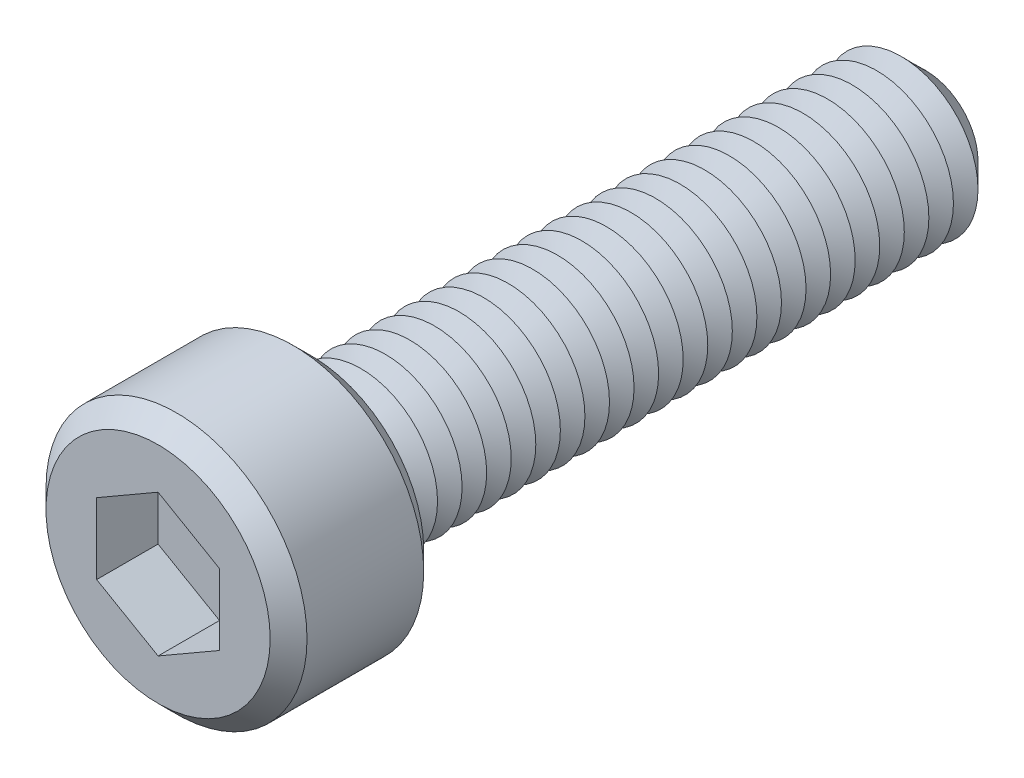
ISO-10303-21;
HEADER;
FILE_DESCRIPTION(('STEP AP214'),'2;1');
FILE_NAME('part.step','',(''),(''),'','','');
FILE_SCHEMA(('AUTOMOTIVE_DESIGN { 1 0 10303 214 1 1 1 1 }'));
ENDSEC;
DATA;
#1=APPLICATION_CONTEXT('core data for automotive mechanical design processes');
#2=APPLICATION_PROTOCOL_DEFINITION('international standard','automotive_design',2000,#1);
#3=PRODUCT_CONTEXT('',#1,'mechanical');
#4=PRODUCT('Part','Part','',(#3));
#5=PRODUCT_RELATED_PRODUCT_CATEGORY('part','',(#4));
#6=PRODUCT_DEFINITION_FORMATION('','',#4);
#7=PRODUCT_DEFINITION_CONTEXT('part definition',#1,'design');
#8=PRODUCT_DEFINITION('design','',#6,#7);
#9=PRODUCT_DEFINITION_SHAPE('','',#8);
#10=(LENGTH_UNIT() NAMED_UNIT(*) SI_UNIT(.MILLI.,.METRE.));
#11=(NAMED_UNIT(*) PLANE_ANGLE_UNIT() SI_UNIT($,.RADIAN.));
#12=(NAMED_UNIT(*) SI_UNIT($,.STERADIAN.) SOLID_ANGLE_UNIT());
#13=UNCERTAINTY_MEASURE_WITH_UNIT(LENGTH_MEASURE(1.E-05),#10,'distance_accuracy_value','');
#14=(GEOMETRIC_REPRESENTATION_CONTEXT(3) GLOBAL_UNCERTAINTY_ASSIGNED_CONTEXT((#13)) GLOBAL_UNIT_ASSIGNED_CONTEXT((#10,
#11,#12)) REPRESENTATION_CONTEXT('',''));
#15=CARTESIAN_POINT('',(0.,0.,0.));
#16=DIRECTION('',(0.,0.,1.));
#17=DIRECTION('',(1.,0.,0.));
#18=AXIS2_PLACEMENT_3D('',#15,#16,#17);
#19=CARTESIAN_POINT('',(0.,0.,5.));
#20=DIRECTION('',(0.,0.,-1.));
#21=DIRECTION('',(-1.,0.,0.));
#22=AXIS2_PLACEMENT_3D('',#19,#20,#21);
#23=CYLINDRICAL_SURFACE('',#22,4.25);
#24=CARTESIAN_POINT('',(0.,0.,0.599999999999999));
#25=DIRECTION('',(0.,0.,1.));
#26=DIRECTION('',(1.,0.,0.));
#27=AXIS2_PLACEMENT_3D('',#24,#25,#26);
#28=CIRCLE('',#27,4.25);
#29=CARTESIAN_POINT('',(4.25,0.,0.599999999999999));
#30=VERTEX_POINT('',#29);
#31=EDGE_CURVE('E368',#30,#30,#28,.T.);
#32=ORIENTED_EDGE('',*,*,#31,.T.);
#33=EDGE_LOOP('',(#32));
#34=FACE_BOUND('',#33,.T.);
#35=CARTESIAN_POINT('',(0.,0.,4.4));
#36=DIRECTION('',(0.,0.,1.));
#37=DIRECTION('',(1.,0.,0.));
#38=AXIS2_PLACEMENT_3D('',#35,#36,#37);
#39=CIRCLE('',#38,4.25);
#40=CARTESIAN_POINT('',(4.25,0.,4.4));
#41=VERTEX_POINT('',#40);
#42=EDGE_CURVE('E364',#41,#41,#39,.F.);
#43=ORIENTED_EDGE('',*,*,#42,.T.);
#44=EDGE_LOOP('',(#43));
#45=FACE_BOUND('',#44,.T.);
#46=ADVANCED_FACE('F39',(#34,#45),#23,.T.);
#47=CARTESIAN_POINT('',(0.,0.,5.));
#48=DIRECTION('',(0.,0.,1.));
#49=DIRECTION('',(1.,0.,0.));
#50=AXIS2_PLACEMENT_3D('',#47,#48,#49);
#51=PLANE('',#50);
#52=CARTESIAN_POINT('',(0.,0.,5.));
#53=DIRECTION('',(0.,0.,1.));
#54=DIRECTION('',(1.,0.,0.));
#55=AXIS2_PLACEMENT_3D('',#52,#53,#54);
#56=CIRCLE('',#55,3.65);
#57=CARTESIAN_POINT('',(3.65,0.,5.));
#58=VERTEX_POINT('',#57);
#59=EDGE_CURVE('E11',#58,#58,#56,.T.);
#60=ORIENTED_EDGE('',*,*,#59,.T.);
#61=EDGE_LOOP('',(#60));
#62=FACE_BOUND('',#61,.T.);
#63=DIRECTION('',(-0.866025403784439,0.5,0.));
#64=VECTOR('',#63,1.);
#65=CARTESIAN_POINT('',(2.,1.15470053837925,5.));
#66=LINE('',#65,#64);
#67=CARTESIAN_POINT('',(2.,1.15470053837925,5.));
#68=VERTEX_POINT('',#67);
#69=CARTESIAN_POINT('',(0.,2.3094010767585,5.));
#70=VERTEX_POINT('',#69);
#71=EDGE_CURVE('E55',#68,#70,#66,.T.);
#72=ORIENTED_EDGE('',*,*,#71,.F.);
#73=DIRECTION('',(0.,1.,0.));
#74=VECTOR('',#73,1.);
#75=CARTESIAN_POINT('',(2.,-1.15470053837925,5.));
#76=LINE('',#75,#74);
#77=CARTESIAN_POINT('',(2.,-1.15470053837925,5.));
#78=VERTEX_POINT('',#77);
#79=EDGE_CURVE('E150',#78,#68,#76,.T.);
#80=ORIENTED_EDGE('',*,*,#79,.F.);
#81=DIRECTION('',(0.866025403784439,0.5,0.));
#82=VECTOR('',#81,1.);
#83=CARTESIAN_POINT('',(0.,-2.3094010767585,5.));
#84=LINE('',#83,#82);
#85=CARTESIAN_POINT('',(0.,-2.3094010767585,5.));
#86=VERTEX_POINT('',#85);
#87=EDGE_CURVE('E147',#86,#78,#84,.T.);
#88=ORIENTED_EDGE('',*,*,#87,.F.);
#89=DIRECTION('',(0.866025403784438,-0.5,0.));
#90=VECTOR('',#89,1.);
#91=CARTESIAN_POINT('',(-2.,-1.15470053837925,5.));
#92=LINE('',#91,#90);
#93=CARTESIAN_POINT('',(-2.,-1.15470053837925,5.));
#94=VERTEX_POINT('',#93);
#95=EDGE_CURVE('E103',#94,#86,#92,.T.);
#96=ORIENTED_EDGE('',*,*,#95,.F.);
#97=DIRECTION('',(0.,-1.,0.));
#98=VECTOR('',#97,1.);
#99=CARTESIAN_POINT('',(-2.,1.15470053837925,5.));
#100=LINE('',#99,#98);
#101=CARTESIAN_POINT('',(-2.,1.15470053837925,5.));
#102=VERTEX_POINT('',#101);
#103=EDGE_CURVE('E141',#102,#94,#100,.T.);
#104=ORIENTED_EDGE('',*,*,#103,.F.);
#105=DIRECTION('',(-0.866025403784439,-0.5,0.));
#106=VECTOR('',#105,1.);
#107=CARTESIAN_POINT('',(0.,2.3094010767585,5.));
#108=LINE('',#107,#106);
#109=EDGE_CURVE('E137',#70,#102,#108,.T.);
#110=ORIENTED_EDGE('',*,*,#109,.F.);
#111=EDGE_LOOP('',(#72,#80,#88,#96,#104,#110));
#112=FACE_BOUND('',#111,.T.);
#113=ADVANCED_FACE('F386',(#62,#112),#51,.T.);
#114=CARTESIAN_POINT('',(0.,0.,0.));
#115=DIRECTION('',(0.,0.,1.));
#116=DIRECTION('',(1.,0.,0.));
#117=AXIS2_PLACEMENT_3D('',#114,#115,#116);
#118=PLANE('',#117);
#119=CARTESIAN_POINT('',(0.,0.,0.));
#120=DIRECTION('',(0.,0.,1.));
#121=DIRECTION('',(1.,0.,0.));
#122=AXIS2_PLACEMENT_3D('',#119,#120,#121);
#123=CIRCLE('',#122,3.65);
#124=CARTESIAN_POINT('',(3.65,0.,0.));
#125=VERTEX_POINT('',#124);
#126=EDGE_CURVE('E48',#125,#125,#123,.F.);
#127=ORIENTED_EDGE('',*,*,#126,.T.);
#128=EDGE_LOOP('',(#127));
#129=FACE_BOUND('',#128,.T.);
#130=CARTESIAN_POINT('',(0.,0.,0.));
#131=DIRECTION('',(0.,0.,1.));
#132=DIRECTION('',(1.,0.,0.));
#133=AXIS2_PLACEMENT_3D('',#130,#131,#132);
#134=CIRCLE('',#133,2.5);
#135=CARTESIAN_POINT('',(2.5,0.,0.));
#136=VERTEX_POINT('',#135);
#137=EDGE_CURVE('E356',#136,#136,#134,.T.);
#138=ORIENTED_EDGE('',*,*,#137,.T.);
#139=EDGE_LOOP('',(#138));
#140=FACE_BOUND('',#139,.T.);
#141=ADVANCED_FACE('F375',(#129,#140),#118,.F.);
#142=CARTESIAN_POINT('',(0.,0.,0.));
#143=DIRECTION('',(0.,0.,1.));
#144=DIRECTION('',(1.,0.,0.));
#145=AXIS2_PLACEMENT_3D('',#142,#143,#144);
#146=CONICAL_SURFACE('',#145,2.5,1.0471975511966);
#147=CARTESIAN_POINT('',(0.,0.,-0.4));
#148=DIRECTION('',(0.,0.,1.));
#149=DIRECTION('',(1.,0.,0.));
#150=AXIS2_PLACEMENT_3D('',#147,#148,#149);
#151=CIRCLE('',#150,1.80717967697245);
#152=CARTESIAN_POINT('',(1.80717967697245,0.,-0.4));
#153=VERTEX_POINT('',#152);
#154=EDGE_CURVE('E352',#153,#153,#151,.T.);
#155=ORIENTED_EDGE('',*,*,#154,.T.);
#156=EDGE_LOOP('',(#155));
#157=FACE_BOUND('',#156,.T.);
#158=ORIENTED_EDGE('',*,*,#137,.F.);
#159=EDGE_LOOP('',(#158));
#160=FACE_BOUND('',#159,.T.);
#161=ADVANCED_FACE('F628',(#157,#160),#146,.T.);
#162=CARTESIAN_POINT('',(0.,0.,-0.4));
#163=DIRECTION('',(0.,0.,-1.));
#164=DIRECTION('',(-1.,0.,0.));
#165=AXIS2_PLACEMENT_3D('',#162,#163,#164);
#166=CONICAL_SURFACE('',#165,1.80717967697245,1.0471975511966);
#167=CARTESIAN_POINT('',(0.,0.,-0.8));
#168=DIRECTION('',(0.,0.,1.));
#169=DIRECTION('',(1.,0.,0.));
#170=AXIS2_PLACEMENT_3D('',#167,#168,#169);
#171=CIRCLE('',#170,2.5);
#172=CARTESIAN_POINT('',(2.5,0.,-0.8));
#173=VERTEX_POINT('',#172);
#174=EDGE_CURVE('E348',#173,#173,#171,.T.);
#175=ORIENTED_EDGE('',*,*,#174,.T.);
#176=EDGE_LOOP('',(#175));
#177=FACE_BOUND('',#176,.T.);
#178=ORIENTED_EDGE('',*,*,#154,.F.);
#179=EDGE_LOOP('',(#178));
#180=FACE_BOUND('',#179,.T.);
#181=ADVANCED_FACE('F624',(#177,#180),#166,.T.);
#182=CARTESIAN_POINT('',(0.,0.,-0.8));
#183=DIRECTION('',(0.,0.,1.));
#184=DIRECTION('',(1.,0.,0.));
#185=AXIS2_PLACEMENT_3D('',#182,#183,#184);
#186=CONICAL_SURFACE('',#185,2.5,1.0471975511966);
#187=CARTESIAN_POINT('',(0.,0.,-1.2));
#188=DIRECTION('',(0.,0.,1.));
#189=DIRECTION('',(1.,0.,0.));
#190=AXIS2_PLACEMENT_3D('',#187,#188,#189);
#191=CIRCLE('',#190,1.80717967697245);
#192=CARTESIAN_POINT('',(1.80717967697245,0.,-1.2));
#193=VERTEX_POINT('',#192);
#194=EDGE_CURVE('E344',#193,#193,#191,.T.);
#195=ORIENTED_EDGE('',*,*,#194,.T.);
#196=EDGE_LOOP('',(#195));
#197=FACE_BOUND('',#196,.T.);
#198=ORIENTED_EDGE('',*,*,#174,.F.);
#199=EDGE_LOOP('',(#198));
#200=FACE_BOUND('',#199,.T.);
#201=ADVANCED_FACE('F620',(#197,#200),#186,.T.);
#202=CARTESIAN_POINT('',(0.,0.,-1.2));
#203=DIRECTION('',(0.,0.,-1.));
#204=DIRECTION('',(-1.,0.,0.));
#205=AXIS2_PLACEMENT_3D('',#202,#203,#204);
#206=CONICAL_SURFACE('',#205,1.80717967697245,1.0471975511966);
#207=CARTESIAN_POINT('',(0.,0.,-1.6));
#208=DIRECTION('',(0.,0.,1.));
#209=DIRECTION('',(1.,0.,0.));
#210=AXIS2_PLACEMENT_3D('',#207,#208,#209);
#211=CIRCLE('',#210,2.5);
#212=CARTESIAN_POINT('',(2.5,0.,-1.6));
#213=VERTEX_POINT('',#212);
#214=EDGE_CURVE('E340',#213,#213,#211,.T.);
#215=ORIENTED_EDGE('',*,*,#214,.T.);
#216=EDGE_LOOP('',(#215));
#217=FACE_BOUND('',#216,.T.);
#218=ORIENTED_EDGE('',*,*,#194,.F.);
#219=EDGE_LOOP('',(#218));
#220=FACE_BOUND('',#219,.T.);
#221=ADVANCED_FACE('F616',(#217,#220),#206,.T.);
#222=CARTESIAN_POINT('',(0.,0.,-1.6));
#223=DIRECTION('',(0.,0.,1.));
#224=DIRECTION('',(1.,0.,0.));
#225=AXIS2_PLACEMENT_3D('',#222,#223,#224);
#226=CONICAL_SURFACE('',#225,2.5,1.0471975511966);
#227=CARTESIAN_POINT('',(0.,0.,-2.));
#228=DIRECTION('',(0.,0.,1.));
#229=DIRECTION('',(1.,0.,0.));
#230=AXIS2_PLACEMENT_3D('',#227,#228,#229);
#231=CIRCLE('',#230,1.80717967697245);
#232=CARTESIAN_POINT('',(1.80717967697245,0.,-2.));
#233=VERTEX_POINT('',#232);
#234=EDGE_CURVE('E336',#233,#233,#231,.T.);
#235=ORIENTED_EDGE('',*,*,#234,.T.);
#236=EDGE_LOOP('',(#235));
#237=FACE_BOUND('',#236,.T.);
#238=ORIENTED_EDGE('',*,*,#214,.F.);
#239=EDGE_LOOP('',(#238));
#240=FACE_BOUND('',#239,.T.);
#241=ADVANCED_FACE('F612',(#237,#240),#226,.T.);
#242=CARTESIAN_POINT('',(0.,0.,-2.));
#243=DIRECTION('',(0.,0.,-1.));
#244=DIRECTION('',(-1.,0.,0.));
#245=AXIS2_PLACEMENT_3D('',#242,#243,#244);
#246=CONICAL_SURFACE('',#245,1.80717967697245,1.0471975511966);
#247=CARTESIAN_POINT('',(0.,0.,-2.4));
#248=DIRECTION('',(0.,0.,1.));
#249=DIRECTION('',(1.,0.,0.));
#250=AXIS2_PLACEMENT_3D('',#247,#248,#249);
#251=CIRCLE('',#250,2.5);
#252=CARTESIAN_POINT('',(2.5,0.,-2.4));
#253=VERTEX_POINT('',#252);
#254=EDGE_CURVE('E332',#253,#253,#251,.T.);
#255=ORIENTED_EDGE('',*,*,#254,.T.);
#256=EDGE_LOOP('',(#255));
#257=FACE_BOUND('',#256,.T.);
#258=ORIENTED_EDGE('',*,*,#234,.F.);
#259=EDGE_LOOP('',(#258));
#260=FACE_BOUND('',#259,.T.);
#261=ADVANCED_FACE('F608',(#257,#260),#246,.T.);
#262=CARTESIAN_POINT('',(0.,0.,-2.4));
#263=DIRECTION('',(0.,0.,1.));
#264=DIRECTION('',(1.,0.,0.));
#265=AXIS2_PLACEMENT_3D('',#262,#263,#264);
#266=CONICAL_SURFACE('',#265,2.5,1.0471975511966);
#267=CARTESIAN_POINT('',(0.,0.,-2.8));
#268=DIRECTION('',(0.,0.,1.));
#269=DIRECTION('',(1.,0.,0.));
#270=AXIS2_PLACEMENT_3D('',#267,#268,#269);
#271=CIRCLE('',#270,1.80717967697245);
#272=CARTESIAN_POINT('',(1.80717967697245,0.,-2.8));
#273=VERTEX_POINT('',#272);
#274=EDGE_CURVE('E328',#273,#273,#271,.T.);
#275=ORIENTED_EDGE('',*,*,#274,.T.);
#276=EDGE_LOOP('',(#275));
#277=FACE_BOUND('',#276,.T.);
#278=ORIENTED_EDGE('',*,*,#254,.F.);
#279=EDGE_LOOP('',(#278));
#280=FACE_BOUND('',#279,.T.);
#281=ADVANCED_FACE('F604',(#277,#280),#266,.T.);
#282=CARTESIAN_POINT('',(0.,0.,-2.8));
#283=DIRECTION('',(0.,0.,-1.));
#284=DIRECTION('',(-1.,0.,0.));
#285=AXIS2_PLACEMENT_3D('',#282,#283,#284);
#286=CONICAL_SURFACE('',#285,1.80717967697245,1.0471975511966);
#287=CARTESIAN_POINT('',(0.,0.,-3.2));
#288=DIRECTION('',(0.,0.,1.));
#289=DIRECTION('',(1.,0.,0.));
#290=AXIS2_PLACEMENT_3D('',#287,#288,#289);
#291=CIRCLE('',#290,2.5);
#292=CARTESIAN_POINT('',(2.5,0.,-3.2));
#293=VERTEX_POINT('',#292);
#294=EDGE_CURVE('E324',#293,#293,#291,.T.);
#295=ORIENTED_EDGE('',*,*,#294,.T.);
#296=EDGE_LOOP('',(#295));
#297=FACE_BOUND('',#296,.T.);
#298=ORIENTED_EDGE('',*,*,#274,.F.);
#299=EDGE_LOOP('',(#298));
#300=FACE_BOUND('',#299,.T.);
#301=ADVANCED_FACE('F600',(#297,#300),#286,.T.);
#302=CARTESIAN_POINT('',(0.,0.,-3.2));
#303=DIRECTION('',(0.,0.,1.));
#304=DIRECTION('',(1.,0.,0.));
#305=AXIS2_PLACEMENT_3D('',#302,#303,#304);
#306=CONICAL_SURFACE('',#305,2.5,1.0471975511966);
#307=CARTESIAN_POINT('',(0.,0.,-3.6));
#308=DIRECTION('',(0.,0.,1.));
#309=DIRECTION('',(1.,0.,0.));
#310=AXIS2_PLACEMENT_3D('',#307,#308,#309);
#311=CIRCLE('',#310,1.80717967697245);
#312=CARTESIAN_POINT('',(1.80717967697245,0.,-3.6));
#313=VERTEX_POINT('',#312);
#314=EDGE_CURVE('E320',#313,#313,#311,.T.);
#315=ORIENTED_EDGE('',*,*,#314,.T.);
#316=EDGE_LOOP('',(#315));
#317=FACE_BOUND('',#316,.T.);
#318=ORIENTED_EDGE('',*,*,#294,.F.);
#319=EDGE_LOOP('',(#318));
#320=FACE_BOUND('',#319,.T.);
#321=ADVANCED_FACE('F596',(#317,#320),#306,.T.);
#322=CARTESIAN_POINT('',(0.,0.,-3.6));
#323=DIRECTION('',(0.,0.,-1.));
#324=DIRECTION('',(-1.,0.,0.));
#325=AXIS2_PLACEMENT_3D('',#322,#323,#324);
#326=CONICAL_SURFACE('',#325,1.80717967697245,1.0471975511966);
#327=CARTESIAN_POINT('',(0.,0.,-4.));
#328=DIRECTION('',(0.,0.,1.));
#329=DIRECTION('',(1.,0.,0.));
#330=AXIS2_PLACEMENT_3D('',#327,#328,#329);
#331=CIRCLE('',#330,2.5);
#332=CARTESIAN_POINT('',(2.5,0.,-4.));
#333=VERTEX_POINT('',#332);
#334=EDGE_CURVE('E316',#333,#333,#331,.T.);
#335=ORIENTED_EDGE('',*,*,#334,.T.);
#336=EDGE_LOOP('',(#335));
#337=FACE_BOUND('',#336,.T.);
#338=ORIENTED_EDGE('',*,*,#314,.F.);
#339=EDGE_LOOP('',(#338));
#340=FACE_BOUND('',#339,.T.);
#341=ADVANCED_FACE('F592',(#337,#340),#326,.T.);
#342=CARTESIAN_POINT('',(0.,0.,-4.));
#343=DIRECTION('',(0.,0.,1.));
#344=DIRECTION('',(1.,0.,0.));
#345=AXIS2_PLACEMENT_3D('',#342,#343,#344);
#346=CONICAL_SURFACE('',#345,2.5,1.0471975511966);
#347=CARTESIAN_POINT('',(0.,0.,-4.4));
#348=DIRECTION('',(0.,0.,1.));
#349=DIRECTION('',(1.,0.,0.));
#350=AXIS2_PLACEMENT_3D('',#347,#348,#349);
#351=CIRCLE('',#350,1.80717967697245);
#352=CARTESIAN_POINT('',(1.80717967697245,0.,-4.4));
#353=VERTEX_POINT('',#352);
#354=EDGE_CURVE('E312',#353,#353,#351,.T.);
#355=ORIENTED_EDGE('',*,*,#354,.T.);
#356=EDGE_LOOP('',(#355));
#357=FACE_BOUND('',#356,.T.);
#358=ORIENTED_EDGE('',*,*,#334,.F.);
#359=EDGE_LOOP('',(#358));
#360=FACE_BOUND('',#359,.T.);
#361=ADVANCED_FACE('F588',(#357,#360),#346,.T.);
#362=CARTESIAN_POINT('',(0.,0.,-4.4));
#363=DIRECTION('',(0.,0.,-1.));
#364=DIRECTION('',(-1.,0.,0.));
#365=AXIS2_PLACEMENT_3D('',#362,#363,#364);
#366=CONICAL_SURFACE('',#365,1.80717967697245,1.0471975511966);
#367=CARTESIAN_POINT('',(0.,0.,-4.8));
#368=DIRECTION('',(0.,0.,1.));
#369=DIRECTION('',(1.,0.,0.));
#370=AXIS2_PLACEMENT_3D('',#367,#368,#369);
#371=CIRCLE('',#370,2.5);
#372=CARTESIAN_POINT('',(2.5,0.,-4.8));
#373=VERTEX_POINT('',#372);
#374=EDGE_CURVE('E308',#373,#373,#371,.T.);
#375=ORIENTED_EDGE('',*,*,#374,.T.);
#376=EDGE_LOOP('',(#375));
#377=FACE_BOUND('',#376,.T.);
#378=ORIENTED_EDGE('',*,*,#354,.F.);
#379=EDGE_LOOP('',(#378));
#380=FACE_BOUND('',#379,.T.);
#381=ADVANCED_FACE('F584',(#377,#380),#366,.T.);
#382=CARTESIAN_POINT('',(0.,0.,-4.8));
#383=DIRECTION('',(0.,0.,1.));
#384=DIRECTION('',(1.,0.,0.));
#385=AXIS2_PLACEMENT_3D('',#382,#383,#384);
#386=CONICAL_SURFACE('',#385,2.5,1.0471975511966);
#387=CARTESIAN_POINT('',(0.,0.,-5.2));
#388=DIRECTION('',(0.,0.,1.));
#389=DIRECTION('',(1.,0.,0.));
#390=AXIS2_PLACEMENT_3D('',#387,#388,#389);
#391=CIRCLE('',#390,1.80717967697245);
#392=CARTESIAN_POINT('',(1.80717967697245,0.,-5.2));
#393=VERTEX_POINT('',#392);
#394=EDGE_CURVE('E304',#393,#393,#391,.T.);
#395=ORIENTED_EDGE('',*,*,#394,.T.);
#396=EDGE_LOOP('',(#395));
#397=FACE_BOUND('',#396,.T.);
#398=ORIENTED_EDGE('',*,*,#374,.F.);
#399=EDGE_LOOP('',(#398));
#400=FACE_BOUND('',#399,.T.);
#401=ADVANCED_FACE('F580',(#397,#400),#386,.T.);
#402=CARTESIAN_POINT('',(0.,0.,-5.2));
#403=DIRECTION('',(0.,0.,-1.));
#404=DIRECTION('',(-1.,0.,0.));
#405=AXIS2_PLACEMENT_3D('',#402,#403,#404);
#406=CONICAL_SURFACE('',#405,1.80717967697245,1.0471975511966);
#407=CARTESIAN_POINT('',(0.,0.,-5.6));
#408=DIRECTION('',(0.,0.,1.));
#409=DIRECTION('',(1.,0.,0.));
#410=AXIS2_PLACEMENT_3D('',#407,#408,#409);
#411=CIRCLE('',#410,2.5);
#412=CARTESIAN_POINT('',(2.5,0.,-5.6));
#413=VERTEX_POINT('',#412);
#414=EDGE_CURVE('E300',#413,#413,#411,.T.);
#415=ORIENTED_EDGE('',*,*,#414,.T.);
#416=EDGE_LOOP('',(#415));
#417=FACE_BOUND('',#416,.T.);
#418=ORIENTED_EDGE('',*,*,#394,.F.);
#419=EDGE_LOOP('',(#418));
#420=FACE_BOUND('',#419,.T.);
#421=ADVANCED_FACE('F576',(#417,#420),#406,.T.);
#422=CARTESIAN_POINT('',(0.,0.,-5.6));
#423=DIRECTION('',(0.,0.,1.));
#424=DIRECTION('',(1.,0.,0.));
#425=AXIS2_PLACEMENT_3D('',#422,#423,#424);
#426=CONICAL_SURFACE('',#425,2.5,1.0471975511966);
#427=CARTESIAN_POINT('',(0.,0.,-6.));
#428=DIRECTION('',(0.,0.,1.));
#429=DIRECTION('',(1.,0.,0.));
#430=AXIS2_PLACEMENT_3D('',#427,#428,#429);
#431=CIRCLE('',#430,1.80717967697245);
#432=CARTESIAN_POINT('',(1.80717967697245,0.,-6.));
#433=VERTEX_POINT('',#432);
#434=EDGE_CURVE('E296',#433,#433,#431,.T.);
#435=ORIENTED_EDGE('',*,*,#434,.T.);
#436=EDGE_LOOP('',(#435));
#437=FACE_BOUND('',#436,.T.);
#438=ORIENTED_EDGE('',*,*,#414,.F.);
#439=EDGE_LOOP('',(#438));
#440=FACE_BOUND('',#439,.T.);
#441=ADVANCED_FACE('F572',(#437,#440),#426,.T.);
#442=CARTESIAN_POINT('',(0.,0.,-6.));
#443=DIRECTION('',(0.,0.,-1.));
#444=DIRECTION('',(-1.,0.,0.));
#445=AXIS2_PLACEMENT_3D('',#442,#443,#444);
#446=CONICAL_SURFACE('',#445,1.80717967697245,1.0471975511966);
#447=CARTESIAN_POINT('',(0.,0.,-6.4));
#448=DIRECTION('',(0.,0.,1.));
#449=DIRECTION('',(1.,0.,0.));
#450=AXIS2_PLACEMENT_3D('',#447,#448,#449);
#451=CIRCLE('',#450,2.5);
#452=CARTESIAN_POINT('',(2.5,0.,-6.4));
#453=VERTEX_POINT('',#452);
#454=EDGE_CURVE('E292',#453,#453,#451,.T.);
#455=ORIENTED_EDGE('',*,*,#454,.T.);
#456=EDGE_LOOP('',(#455));
#457=FACE_BOUND('',#456,.T.);
#458=ORIENTED_EDGE('',*,*,#434,.F.);
#459=EDGE_LOOP('',(#458));
#460=FACE_BOUND('',#459,.T.);
#461=ADVANCED_FACE('F568',(#457,#460),#446,.T.);
#462=CARTESIAN_POINT('',(0.,0.,-6.4));
#463=DIRECTION('',(0.,0.,1.));
#464=DIRECTION('',(1.,0.,0.));
#465=AXIS2_PLACEMENT_3D('',#462,#463,#464);
#466=CONICAL_SURFACE('',#465,2.5,1.0471975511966);
#467=CARTESIAN_POINT('',(0.,0.,-6.8));
#468=DIRECTION('',(0.,0.,1.));
#469=DIRECTION('',(1.,0.,0.));
#470=AXIS2_PLACEMENT_3D('',#467,#468,#469);
#471=CIRCLE('',#470,1.80717967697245);
#472=CARTESIAN_POINT('',(1.80717967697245,0.,-6.8));
#473=VERTEX_POINT('',#472);
#474=EDGE_CURVE('E288',#473,#473,#471,.T.);
#475=ORIENTED_EDGE('',*,*,#474,.T.);
#476=EDGE_LOOP('',(#475));
#477=FACE_BOUND('',#476,.T.);
#478=ORIENTED_EDGE('',*,*,#454,.F.);
#479=EDGE_LOOP('',(#478));
#480=FACE_BOUND('',#479,.T.);
#481=ADVANCED_FACE('F564',(#477,#480),#466,.T.);
#482=CARTESIAN_POINT('',(0.,0.,-6.8));
#483=DIRECTION('',(0.,0.,-1.));
#484=DIRECTION('',(-1.,0.,0.));
#485=AXIS2_PLACEMENT_3D('',#482,#483,#484);
#486=CONICAL_SURFACE('',#485,1.80717967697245,1.0471975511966);
#487=CARTESIAN_POINT('',(0.,0.,-7.2));
#488=DIRECTION('',(0.,0.,1.));
#489=DIRECTION('',(1.,0.,0.));
#490=AXIS2_PLACEMENT_3D('',#487,#488,#489);
#491=CIRCLE('',#490,2.5);
#492=CARTESIAN_POINT('',(2.5,0.,-7.2));
#493=VERTEX_POINT('',#492);
#494=EDGE_CURVE('E284',#493,#493,#491,.T.);
#495=ORIENTED_EDGE('',*,*,#494,.T.);
#496=EDGE_LOOP('',(#495));
#497=FACE_BOUND('',#496,.T.);
#498=ORIENTED_EDGE('',*,*,#474,.F.);
#499=EDGE_LOOP('',(#498));
#500=FACE_BOUND('',#499,.T.);
#501=ADVANCED_FACE('F560',(#497,#500),#486,.T.);
#502=CARTESIAN_POINT('',(0.,0.,-7.2));
#503=DIRECTION('',(0.,0.,1.));
#504=DIRECTION('',(1.,0.,0.));
#505=AXIS2_PLACEMENT_3D('',#502,#503,#504);
#506=CONICAL_SURFACE('',#505,2.5,1.0471975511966);
#507=CARTESIAN_POINT('',(0.,0.,-7.6));
#508=DIRECTION('',(0.,0.,1.));
#509=DIRECTION('',(1.,0.,0.));
#510=AXIS2_PLACEMENT_3D('',#507,#508,#509);
#511=CIRCLE('',#510,1.80717967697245);
#512=CARTESIAN_POINT('',(1.80717967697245,0.,-7.6));
#513=VERTEX_POINT('',#512);
#514=EDGE_CURVE('E280',#513,#513,#511,.T.);
#515=ORIENTED_EDGE('',*,*,#514,.T.);
#516=EDGE_LOOP('',(#515));
#517=FACE_BOUND('',#516,.T.);
#518=ORIENTED_EDGE('',*,*,#494,.F.);
#519=EDGE_LOOP('',(#518));
#520=FACE_BOUND('',#519,.T.);
#521=ADVANCED_FACE('F556',(#517,#520),#506,.T.);
#522=CARTESIAN_POINT('',(0.,0.,-7.6));
#523=DIRECTION('',(0.,0.,-1.));
#524=DIRECTION('',(-1.,0.,0.));
#525=AXIS2_PLACEMENT_3D('',#522,#523,#524);
#526=CONICAL_SURFACE('',#525,1.80717967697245,1.0471975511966);
#527=CARTESIAN_POINT('',(0.,0.,-8.));
#528=DIRECTION('',(0.,0.,1.));
#529=DIRECTION('',(1.,0.,0.));
#530=AXIS2_PLACEMENT_3D('',#527,#528,#529);
#531=CIRCLE('',#530,2.5);
#532=CARTESIAN_POINT('',(2.5,0.,-8.));
#533=VERTEX_POINT('',#532);
#534=EDGE_CURVE('E276',#533,#533,#531,.T.);
#535=ORIENTED_EDGE('',*,*,#534,.T.);
#536=EDGE_LOOP('',(#535));
#537=FACE_BOUND('',#536,.T.);
#538=ORIENTED_EDGE('',*,*,#514,.F.);
#539=EDGE_LOOP('',(#538));
#540=FACE_BOUND('',#539,.T.);
#541=ADVANCED_FACE('F552',(#537,#540),#526,.T.);
#542=CARTESIAN_POINT('',(0.,0.,-8.));
#543=DIRECTION('',(0.,0.,1.));
#544=DIRECTION('',(1.,0.,0.));
#545=AXIS2_PLACEMENT_3D('',#542,#543,#544);
#546=CONICAL_SURFACE('',#545,2.5,1.0471975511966);
#547=CARTESIAN_POINT('',(0.,0.,-8.4));
#548=DIRECTION('',(0.,0.,1.));
#549=DIRECTION('',(1.,0.,0.));
#550=AXIS2_PLACEMENT_3D('',#547,#548,#549);
#551=CIRCLE('',#550,1.80717967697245);
#552=CARTESIAN_POINT('',(1.80717967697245,0.,-8.4));
#553=VERTEX_POINT('',#552);
#554=EDGE_CURVE('E272',#553,#553,#551,.T.);
#555=ORIENTED_EDGE('',*,*,#554,.T.);
#556=EDGE_LOOP('',(#555));
#557=FACE_BOUND('',#556,.T.);
#558=ORIENTED_EDGE('',*,*,#534,.F.);
#559=EDGE_LOOP('',(#558));
#560=FACE_BOUND('',#559,.T.);
#561=ADVANCED_FACE('F548',(#557,#560),#546,.T.);
#562=CARTESIAN_POINT('',(0.,0.,-8.4));
#563=DIRECTION('',(0.,0.,-1.));
#564=DIRECTION('',(-1.,0.,0.));
#565=AXIS2_PLACEMENT_3D('',#562,#563,#564);
#566=CONICAL_SURFACE('',#565,1.80717967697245,1.0471975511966);
#567=CARTESIAN_POINT('',(0.,0.,-8.8));
#568=DIRECTION('',(0.,0.,1.));
#569=DIRECTION('',(1.,0.,0.));
#570=AXIS2_PLACEMENT_3D('',#567,#568,#569);
#571=CIRCLE('',#570,2.5);
#572=CARTESIAN_POINT('',(2.5,0.,-8.8));
#573=VERTEX_POINT('',#572);
#574=EDGE_CURVE('E268',#573,#573,#571,.T.);
#575=ORIENTED_EDGE('',*,*,#574,.T.);
#576=EDGE_LOOP('',(#575));
#577=FACE_BOUND('',#576,.T.);
#578=ORIENTED_EDGE('',*,*,#554,.F.);
#579=EDGE_LOOP('',(#578));
#580=FACE_BOUND('',#579,.T.);
#581=ADVANCED_FACE('F544',(#577,#580),#566,.T.);
#582=CARTESIAN_POINT('',(0.,0.,-8.8));
#583=DIRECTION('',(0.,0.,1.));
#584=DIRECTION('',(1.,0.,0.));
#585=AXIS2_PLACEMENT_3D('',#582,#583,#584);
#586=CONICAL_SURFACE('',#585,2.5,1.0471975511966);
#587=CARTESIAN_POINT('',(0.,0.,-9.2));
#588=DIRECTION('',(0.,0.,1.));
#589=DIRECTION('',(1.,0.,0.));
#590=AXIS2_PLACEMENT_3D('',#587,#588,#589);
#591=CIRCLE('',#590,1.80717967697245);
#592=CARTESIAN_POINT('',(1.80717967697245,0.,-9.2));
#593=VERTEX_POINT('',#592);
#594=EDGE_CURVE('E264',#593,#593,#591,.T.);
#595=ORIENTED_EDGE('',*,*,#594,.T.);
#596=EDGE_LOOP('',(#595));
#597=FACE_BOUND('',#596,.T.);
#598=ORIENTED_EDGE('',*,*,#574,.F.);
#599=EDGE_LOOP('',(#598));
#600=FACE_BOUND('',#599,.T.);
#601=ADVANCED_FACE('F540',(#597,#600),#586,.T.);
#602=CARTESIAN_POINT('',(0.,0.,-9.2));
#603=DIRECTION('',(0.,0.,-1.));
#604=DIRECTION('',(-1.,0.,0.));
#605=AXIS2_PLACEMENT_3D('',#602,#603,#604);
#606=CONICAL_SURFACE('',#605,1.80717967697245,1.0471975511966);
#607=CARTESIAN_POINT('',(0.,0.,-9.6));
#608=DIRECTION('',(0.,0.,1.));
#609=DIRECTION('',(1.,0.,0.));
#610=AXIS2_PLACEMENT_3D('',#607,#608,#609);
#611=CIRCLE('',#610,2.5);
#612=CARTESIAN_POINT('',(2.5,0.,-9.6));
#613=VERTEX_POINT('',#612);
#614=EDGE_CURVE('E260',#613,#613,#611,.T.);
#615=ORIENTED_EDGE('',*,*,#614,.T.);
#616=EDGE_LOOP('',(#615));
#617=FACE_BOUND('',#616,.T.);
#618=ORIENTED_EDGE('',*,*,#594,.F.);
#619=EDGE_LOOP('',(#618));
#620=FACE_BOUND('',#619,.T.);
#621=ADVANCED_FACE('F536',(#617,#620),#606,.T.);
#622=CARTESIAN_POINT('',(0.,0.,-9.6));
#623=DIRECTION('',(0.,0.,1.));
#624=DIRECTION('',(1.,0.,0.));
#625=AXIS2_PLACEMENT_3D('',#622,#623,#624);
#626=CONICAL_SURFACE('',#625,2.5,1.0471975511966);
#627=CARTESIAN_POINT('',(0.,0.,-10.));
#628=DIRECTION('',(0.,0.,1.));
#629=DIRECTION('',(1.,0.,0.));
#630=AXIS2_PLACEMENT_3D('',#627,#628,#629);
#631=CIRCLE('',#630,1.80717967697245);
#632=CARTESIAN_POINT('',(1.80717967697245,0.,-10.));
#633=VERTEX_POINT('',#632);
#634=EDGE_CURVE('E256',#633,#633,#631,.T.);
#635=ORIENTED_EDGE('',*,*,#634,.T.);
#636=EDGE_LOOP('',(#635));
#637=FACE_BOUND('',#636,.T.);
#638=ORIENTED_EDGE('',*,*,#614,.F.);
#639=EDGE_LOOP('',(#638));
#640=FACE_BOUND('',#639,.T.);
#641=ADVANCED_FACE('F532',(#637,#640),#626,.T.);
#642=CARTESIAN_POINT('',(0.,0.,-10.));
#643=DIRECTION('',(0.,0.,-1.));
#644=DIRECTION('',(-1.,0.,0.));
#645=AXIS2_PLACEMENT_3D('',#642,#643,#644);
#646=CONICAL_SURFACE('',#645,1.80717967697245,1.0471975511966);
#647=CARTESIAN_POINT('',(0.,0.,-10.4));
#648=DIRECTION('',(0.,0.,1.));
#649=DIRECTION('',(1.,0.,0.));
#650=AXIS2_PLACEMENT_3D('',#647,#648,#649);
#651=CIRCLE('',#650,2.5);
#652=CARTESIAN_POINT('',(2.5,0.,-10.4));
#653=VERTEX_POINT('',#652);
#654=EDGE_CURVE('E252',#653,#653,#651,.T.);
#655=ORIENTED_EDGE('',*,*,#654,.T.);
#656=EDGE_LOOP('',(#655));
#657=FACE_BOUND('',#656,.T.);
#658=ORIENTED_EDGE('',*,*,#634,.F.);
#659=EDGE_LOOP('',(#658));
#660=FACE_BOUND('',#659,.T.);
#661=ADVANCED_FACE('F528',(#657,#660),#646,.T.);
#662=CARTESIAN_POINT('',(0.,0.,-10.4));
#663=DIRECTION('',(0.,0.,1.));
#664=DIRECTION('',(1.,0.,0.));
#665=AXIS2_PLACEMENT_3D('',#662,#663,#664);
#666=CONICAL_SURFACE('',#665,2.5,1.0471975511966);
#667=CARTESIAN_POINT('',(0.,0.,-10.8));
#668=DIRECTION('',(0.,0.,1.));
#669=DIRECTION('',(1.,0.,0.));
#670=AXIS2_PLACEMENT_3D('',#667,#668,#669);
#671=CIRCLE('',#670,1.80717967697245);
#672=CARTESIAN_POINT('',(1.80717967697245,0.,-10.8));
#673=VERTEX_POINT('',#672);
#674=EDGE_CURVE('E248',#673,#673,#671,.T.);
#675=ORIENTED_EDGE('',*,*,#674,.T.);
#676=EDGE_LOOP('',(#675));
#677=FACE_BOUND('',#676,.T.);
#678=ORIENTED_EDGE('',*,*,#654,.F.);
#679=EDGE_LOOP('',(#678));
#680=FACE_BOUND('',#679,.T.);
#681=ADVANCED_FACE('F524',(#677,#680),#666,.T.);
#682=CARTESIAN_POINT('',(0.,0.,-10.8));
#683=DIRECTION('',(0.,0.,-1.));
#684=DIRECTION('',(-1.,0.,0.));
#685=AXIS2_PLACEMENT_3D('',#682,#683,#684);
#686=CONICAL_SURFACE('',#685,1.80717967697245,1.0471975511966);
#687=CARTESIAN_POINT('',(0.,0.,-11.2));
#688=DIRECTION('',(0.,0.,1.));
#689=DIRECTION('',(1.,0.,0.));
#690=AXIS2_PLACEMENT_3D('',#687,#688,#689);
#691=CIRCLE('',#690,2.5);
#692=CARTESIAN_POINT('',(2.5,0.,-11.2));
#693=VERTEX_POINT('',#692);
#694=EDGE_CURVE('E244',#693,#693,#691,.T.);
#695=ORIENTED_EDGE('',*,*,#694,.T.);
#696=EDGE_LOOP('',(#695));
#697=FACE_BOUND('',#696,.T.);
#698=ORIENTED_EDGE('',*,*,#674,.F.);
#699=EDGE_LOOP('',(#698));
#700=FACE_BOUND('',#699,.T.);
#701=ADVANCED_FACE('F520',(#697,#700),#686,.T.);
#702=CARTESIAN_POINT('',(0.,0.,-11.2));
#703=DIRECTION('',(0.,0.,1.));
#704=DIRECTION('',(1.,0.,0.));
#705=AXIS2_PLACEMENT_3D('',#702,#703,#704);
#706=CONICAL_SURFACE('',#705,2.5,1.0471975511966);
#707=CARTESIAN_POINT('',(0.,0.,-11.6));
#708=DIRECTION('',(0.,0.,1.));
#709=DIRECTION('',(1.,0.,0.));
#710=AXIS2_PLACEMENT_3D('',#707,#708,#709);
#711=CIRCLE('',#710,1.80717967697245);
#712=CARTESIAN_POINT('',(1.80717967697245,0.,-11.6));
#713=VERTEX_POINT('',#712);
#714=EDGE_CURVE('E240',#713,#713,#711,.T.);
#715=ORIENTED_EDGE('',*,*,#714,.T.);
#716=EDGE_LOOP('',(#715));
#717=FACE_BOUND('',#716,.T.);
#718=ORIENTED_EDGE('',*,*,#694,.F.);
#719=EDGE_LOOP('',(#718));
#720=FACE_BOUND('',#719,.T.);
#721=ADVANCED_FACE('F516',(#717,#720),#706,.T.);
#722=CARTESIAN_POINT('',(0.,0.,-11.6));
#723=DIRECTION('',(0.,0.,-1.));
#724=DIRECTION('',(-1.,0.,0.));
#725=AXIS2_PLACEMENT_3D('',#722,#723,#724);
#726=CONICAL_SURFACE('',#725,1.80717967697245,1.0471975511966);
#727=CARTESIAN_POINT('',(0.,0.,-12.));
#728=DIRECTION('',(0.,0.,1.));
#729=DIRECTION('',(1.,0.,0.));
#730=AXIS2_PLACEMENT_3D('',#727,#728,#729);
#731=CIRCLE('',#730,2.5);
#732=CARTESIAN_POINT('',(2.5,0.,-12.));
#733=VERTEX_POINT('',#732);
#734=EDGE_CURVE('E236',#733,#733,#731,.T.);
#735=ORIENTED_EDGE('',*,*,#734,.T.);
#736=EDGE_LOOP('',(#735));
#737=FACE_BOUND('',#736,.T.);
#738=ORIENTED_EDGE('',*,*,#714,.F.);
#739=EDGE_LOOP('',(#738));
#740=FACE_BOUND('',#739,.T.);
#741=ADVANCED_FACE('F512',(#737,#740),#726,.T.);
#742=CARTESIAN_POINT('',(0.,0.,-12.));
#743=DIRECTION('',(0.,0.,1.));
#744=DIRECTION('',(1.,0.,0.));
#745=AXIS2_PLACEMENT_3D('',#742,#743,#744);
#746=CONICAL_SURFACE('',#745,2.5,1.0471975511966);
#747=CARTESIAN_POINT('',(0.,0.,-12.4));
#748=DIRECTION('',(0.,0.,1.));
#749=DIRECTION('',(1.,0.,0.));
#750=AXIS2_PLACEMENT_3D('',#747,#748,#749);
#751=CIRCLE('',#750,1.80717967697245);
#752=CARTESIAN_POINT('',(1.80717967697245,0.,-12.4));
#753=VERTEX_POINT('',#752);
#754=EDGE_CURVE('E232',#753,#753,#751,.T.);
#755=ORIENTED_EDGE('',*,*,#754,.T.);
#756=EDGE_LOOP('',(#755));
#757=FACE_BOUND('',#756,.T.);
#758=ORIENTED_EDGE('',*,*,#734,.F.);
#759=EDGE_LOOP('',(#758));
#760=FACE_BOUND('',#759,.T.);
#761=ADVANCED_FACE('F508',(#757,#760),#746,.T.);
#762=CARTESIAN_POINT('',(0.,0.,-12.4));
#763=DIRECTION('',(0.,0.,-1.));
#764=DIRECTION('',(-1.,0.,0.));
#765=AXIS2_PLACEMENT_3D('',#762,#763,#764);
#766=CONICAL_SURFACE('',#765,1.80717967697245,1.0471975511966);
#767=CARTESIAN_POINT('',(0.,0.,-12.8));
#768=DIRECTION('',(0.,0.,1.));
#769=DIRECTION('',(1.,0.,0.));
#770=AXIS2_PLACEMENT_3D('',#767,#768,#769);
#771=CIRCLE('',#770,2.5);
#772=CARTESIAN_POINT('',(2.5,0.,-12.8));
#773=VERTEX_POINT('',#772);
#774=EDGE_CURVE('E228',#773,#773,#771,.T.);
#775=ORIENTED_EDGE('',*,*,#774,.T.);
#776=EDGE_LOOP('',(#775));
#777=FACE_BOUND('',#776,.T.);
#778=ORIENTED_EDGE('',*,*,#754,.F.);
#779=EDGE_LOOP('',(#778));
#780=FACE_BOUND('',#779,.T.);
#781=ADVANCED_FACE('F504',(#777,#780),#766,.T.);
#782=CARTESIAN_POINT('',(0.,0.,-12.8));
#783=DIRECTION('',(0.,0.,1.));
#784=DIRECTION('',(1.,0.,0.));
#785=AXIS2_PLACEMENT_3D('',#782,#783,#784);
#786=CONICAL_SURFACE('',#785,2.5,1.0471975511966);
#787=CARTESIAN_POINT('',(0.,0.,-13.2));
#788=DIRECTION('',(0.,0.,1.));
#789=DIRECTION('',(1.,0.,0.));
#790=AXIS2_PLACEMENT_3D('',#787,#788,#789);
#791=CIRCLE('',#790,1.80717967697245);
#792=CARTESIAN_POINT('',(1.80717967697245,0.,-13.2));
#793=VERTEX_POINT('',#792);
#794=EDGE_CURVE('E224',#793,#793,#791,.T.);
#795=ORIENTED_EDGE('',*,*,#794,.T.);
#796=EDGE_LOOP('',(#795));
#797=FACE_BOUND('',#796,.T.);
#798=ORIENTED_EDGE('',*,*,#774,.F.);
#799=EDGE_LOOP('',(#798));
#800=FACE_BOUND('',#799,.T.);
#801=ADVANCED_FACE('F500',(#797,#800),#786,.T.);
#802=CARTESIAN_POINT('',(0.,0.,-13.2));
#803=DIRECTION('',(0.,0.,-1.));
#804=DIRECTION('',(-1.,0.,0.));
#805=AXIS2_PLACEMENT_3D('',#802,#803,#804);
#806=CONICAL_SURFACE('',#805,1.80717967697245,1.0471975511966);
#807=CARTESIAN_POINT('',(0.,0.,-13.6));
#808=DIRECTION('',(0.,0.,1.));
#809=DIRECTION('',(1.,0.,0.));
#810=AXIS2_PLACEMENT_3D('',#807,#808,#809);
#811=CIRCLE('',#810,2.5);
#812=CARTESIAN_POINT('',(2.5,0.,-13.6));
#813=VERTEX_POINT('',#812);
#814=EDGE_CURVE('E220',#813,#813,#811,.T.);
#815=ORIENTED_EDGE('',*,*,#814,.T.);
#816=EDGE_LOOP('',(#815));
#817=FACE_BOUND('',#816,.T.);
#818=ORIENTED_EDGE('',*,*,#794,.F.);
#819=EDGE_LOOP('',(#818));
#820=FACE_BOUND('',#819,.T.);
#821=ADVANCED_FACE('F496',(#817,#820),#806,.T.);
#822=CARTESIAN_POINT('',(0.,0.,-13.6));
#823=DIRECTION('',(0.,0.,1.));
#824=DIRECTION('',(1.,0.,0.));
#825=AXIS2_PLACEMENT_3D('',#822,#823,#824);
#826=CONICAL_SURFACE('',#825,2.5,1.0471975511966);
#827=CARTESIAN_POINT('',(0.,0.,-14.));
#828=DIRECTION('',(0.,0.,1.));
#829=DIRECTION('',(1.,0.,0.));
#830=AXIS2_PLACEMENT_3D('',#827,#828,#829);
#831=CIRCLE('',#830,1.80717967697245);
#832=CARTESIAN_POINT('',(1.80717967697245,0.,-14.));
#833=VERTEX_POINT('',#832);
#834=EDGE_CURVE('E216',#833,#833,#831,.T.);
#835=ORIENTED_EDGE('',*,*,#834,.T.);
#836=EDGE_LOOP('',(#835));
#837=FACE_BOUND('',#836,.T.);
#838=ORIENTED_EDGE('',*,*,#814,.F.);
#839=EDGE_LOOP('',(#838));
#840=FACE_BOUND('',#839,.T.);
#841=ADVANCED_FACE('F492',(#837,#840),#826,.T.);
#842=CARTESIAN_POINT('',(0.,0.,-14.));
#843=DIRECTION('',(0.,0.,-1.));
#844=DIRECTION('',(-1.,0.,0.));
#845=AXIS2_PLACEMENT_3D('',#842,#843,#844);
#846=CONICAL_SURFACE('',#845,1.80717967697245,1.0471975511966);
#847=CARTESIAN_POINT('',(0.,0.,-14.4));
#848=DIRECTION('',(0.,0.,1.));
#849=DIRECTION('',(1.,0.,0.));
#850=AXIS2_PLACEMENT_3D('',#847,#848,#849);
#851=CIRCLE('',#850,2.5);
#852=CARTESIAN_POINT('',(2.5,0.,-14.4));
#853=VERTEX_POINT('',#852);
#854=EDGE_CURVE('E212',#853,#853,#851,.T.);
#855=ORIENTED_EDGE('',*,*,#854,.T.);
#856=EDGE_LOOP('',(#855));
#857=FACE_BOUND('',#856,.T.);
#858=ORIENTED_EDGE('',*,*,#834,.F.);
#859=EDGE_LOOP('',(#858));
#860=FACE_BOUND('',#859,.T.);
#861=ADVANCED_FACE('F488',(#857,#860),#846,.T.);
#862=CARTESIAN_POINT('',(0.,0.,-14.4));
#863=DIRECTION('',(0.,0.,1.));
#864=DIRECTION('',(1.,0.,0.));
#865=AXIS2_PLACEMENT_3D('',#862,#863,#864);
#866=CONICAL_SURFACE('',#865,2.5,1.0471975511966);
#867=CARTESIAN_POINT('',(0.,0.,-14.8));
#868=DIRECTION('',(0.,0.,1.));
#869=DIRECTION('',(1.,0.,0.));
#870=AXIS2_PLACEMENT_3D('',#867,#868,#869);
#871=CIRCLE('',#870,1.80717967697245);
#872=CARTESIAN_POINT('',(1.80717967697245,0.,-14.8));
#873=VERTEX_POINT('',#872);
#874=EDGE_CURVE('E208',#873,#873,#871,.T.);
#875=ORIENTED_EDGE('',*,*,#874,.T.);
#876=EDGE_LOOP('',(#875));
#877=FACE_BOUND('',#876,.T.);
#878=ORIENTED_EDGE('',*,*,#854,.F.);
#879=EDGE_LOOP('',(#878));
#880=FACE_BOUND('',#879,.T.);
#881=ADVANCED_FACE('F484',(#877,#880),#866,.T.);
#882=CARTESIAN_POINT('',(0.,0.,-14.8));
#883=DIRECTION('',(0.,0.,-1.));
#884=DIRECTION('',(-1.,0.,0.));
#885=AXIS2_PLACEMENT_3D('',#882,#883,#884);
#886=CONICAL_SURFACE('',#885,1.80717967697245,1.0471975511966);
#887=CARTESIAN_POINT('',(0.,0.,-15.2));
#888=DIRECTION('',(0.,0.,1.));
#889=DIRECTION('',(1.,0.,0.));
#890=AXIS2_PLACEMENT_3D('',#887,#888,#889);
#891=CIRCLE('',#890,2.5);
#892=CARTESIAN_POINT('',(2.5,0.,-15.2));
#893=VERTEX_POINT('',#892);
#894=EDGE_CURVE('E204',#893,#893,#891,.T.);
#895=ORIENTED_EDGE('',*,*,#894,.T.);
#896=EDGE_LOOP('',(#895));
#897=FACE_BOUND('',#896,.T.);
#898=ORIENTED_EDGE('',*,*,#874,.F.);
#899=EDGE_LOOP('',(#898));
#900=FACE_BOUND('',#899,.T.);
#901=ADVANCED_FACE('F480',(#897,#900),#886,.T.);
#902=CARTESIAN_POINT('',(0.,0.,-15.2));
#903=DIRECTION('',(0.,0.,1.));
#904=DIRECTION('',(1.,0.,0.));
#905=AXIS2_PLACEMENT_3D('',#902,#903,#904);
#906=CONICAL_SURFACE('',#905,2.5,1.0471975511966);
#907=CARTESIAN_POINT('',(0.,0.,-15.6));
#908=DIRECTION('',(0.,0.,1.));
#909=DIRECTION('',(1.,0.,0.));
#910=AXIS2_PLACEMENT_3D('',#907,#908,#909);
#911=CIRCLE('',#910,1.80717967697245);
#912=CARTESIAN_POINT('',(1.80717967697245,0.,-15.6));
#913=VERTEX_POINT('',#912);
#914=EDGE_CURVE('E200',#913,#913,#911,.T.);
#915=ORIENTED_EDGE('',*,*,#914,.T.);
#916=EDGE_LOOP('',(#915));
#917=FACE_BOUND('',#916,.T.);
#918=ORIENTED_EDGE('',*,*,#894,.F.);
#919=EDGE_LOOP('',(#918));
#920=FACE_BOUND('',#919,.T.);
#921=ADVANCED_FACE('F476',(#917,#920),#906,.T.);
#922=CARTESIAN_POINT('',(0.,0.,-15.6));
#923=DIRECTION('',(0.,0.,-1.));
#924=DIRECTION('',(-1.,0.,0.));
#925=AXIS2_PLACEMENT_3D('',#922,#923,#924);
#926=CONICAL_SURFACE('',#925,1.80717967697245,1.0471975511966);
#927=CARTESIAN_POINT('',(0.,0.,-16.));
#928=DIRECTION('',(0.,0.,1.));
#929=DIRECTION('',(1.,0.,0.));
#930=AXIS2_PLACEMENT_3D('',#927,#928,#929);
#931=CIRCLE('',#930,2.5);
#932=CARTESIAN_POINT('',(2.5,0.,-16.));
#933=VERTEX_POINT('',#932);
#934=EDGE_CURVE('E196',#933,#933,#931,.T.);
#935=ORIENTED_EDGE('',*,*,#934,.T.);
#936=EDGE_LOOP('',(#935));
#937=FACE_BOUND('',#936,.T.);
#938=ORIENTED_EDGE('',*,*,#914,.F.);
#939=EDGE_LOOP('',(#938));
#940=FACE_BOUND('',#939,.T.);
#941=ADVANCED_FACE('F472',(#937,#940),#926,.T.);
#942=CARTESIAN_POINT('',(0.,0.,-16.));
#943=DIRECTION('',(0.,0.,1.));
#944=DIRECTION('',(1.,0.,0.));
#945=AXIS2_PLACEMENT_3D('',#942,#943,#944);
#946=CONICAL_SURFACE('',#945,2.5,1.0471975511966);
#947=CARTESIAN_POINT('',(0.,0.,-16.4));
#948=DIRECTION('',(0.,0.,1.));
#949=DIRECTION('',(1.,0.,0.));
#950=AXIS2_PLACEMENT_3D('',#947,#948,#949);
#951=CIRCLE('',#950,1.80717967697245);
#952=CARTESIAN_POINT('',(1.80717967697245,0.,-16.4));
#953=VERTEX_POINT('',#952);
#954=EDGE_CURVE('E192',#953,#953,#951,.T.);
#955=ORIENTED_EDGE('',*,*,#954,.T.);
#956=EDGE_LOOP('',(#955));
#957=FACE_BOUND('',#956,.T.);
#958=ORIENTED_EDGE('',*,*,#934,.F.);
#959=EDGE_LOOP('',(#958));
#960=FACE_BOUND('',#959,.T.);
#961=ADVANCED_FACE('F468',(#957,#960),#946,.T.);
#962=CARTESIAN_POINT('',(0.,0.,-16.4));
#963=DIRECTION('',(0.,0.,-1.));
#964=DIRECTION('',(-1.,0.,0.));
#965=AXIS2_PLACEMENT_3D('',#962,#963,#964);
#966=CONICAL_SURFACE('',#965,1.80717967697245,1.0471975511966);
#967=CARTESIAN_POINT('',(0.,0.,-16.8));
#968=DIRECTION('',(0.,0.,1.));
#969=DIRECTION('',(1.,0.,0.));
#970=AXIS2_PLACEMENT_3D('',#967,#968,#969);
#971=CIRCLE('',#970,2.5);
#972=CARTESIAN_POINT('',(2.5,0.,-16.8));
#973=VERTEX_POINT('',#972);
#974=EDGE_CURVE('E189',#973,#973,#971,.T.);
#975=ORIENTED_EDGE('',*,*,#974,.T.);
#976=EDGE_LOOP('',(#975));
#977=FACE_BOUND('',#976,.T.);
#978=ORIENTED_EDGE('',*,*,#954,.F.);
#979=EDGE_LOOP('',(#978));
#980=FACE_BOUND('',#979,.T.);
#981=ADVANCED_FACE('F464',(#977,#980),#966,.T.);
#982=CARTESIAN_POINT('',(0.,0.,-16.8));
#983=DIRECTION('',(0.,0.,1.));
#984=DIRECTION('',(1.,0.,0.));
#985=AXIS2_PLACEMENT_3D('',#982,#983,#984);
#986=CONICAL_SURFACE('',#985,2.5,1.0471975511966);
#987=CARTESIAN_POINT('',(0.,0.,-17.2));
#988=DIRECTION('',(0.,0.,1.));
#989=DIRECTION('',(1.,0.,0.));
#990=AXIS2_PLACEMENT_3D('',#987,#988,#989);
#991=CIRCLE('',#990,1.80717967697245);
#992=CARTESIAN_POINT('',(1.80717967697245,0.,-17.2));
#993=VERTEX_POINT('',#992);
#994=EDGE_CURVE('E185',#993,#993,#991,.T.);
#995=ORIENTED_EDGE('',*,*,#994,.T.);
#996=EDGE_LOOP('',(#995));
#997=FACE_BOUND('',#996,.T.);
#998=ORIENTED_EDGE('',*,*,#974,.F.);
#999=EDGE_LOOP('',(#998));
#1000=FACE_BOUND('',#999,.T.);
#1001=ADVANCED_FACE('F460',(#997,#1000),#986,.T.);
#1002=CARTESIAN_POINT('',(0.,0.,-17.2));
#1003=DIRECTION('',(0.,0.,-1.));
#1004=DIRECTION('',(-1.,0.,0.));
#1005=AXIS2_PLACEMENT_3D('',#1002,#1003,#1004);
#1006=CONICAL_SURFACE('',#1005,1.80717967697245,1.0471975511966);
#1007=CARTESIAN_POINT('',(0.,0.,-17.6));
#1008=DIRECTION('',(0.,0.,1.));
#1009=DIRECTION('',(1.,0.,0.));
#1010=AXIS2_PLACEMENT_3D('',#1007,#1008,#1009);
#1011=CIRCLE('',#1010,2.5);
#1012=CARTESIAN_POINT('',(2.5,0.,-17.6));
#1013=VERTEX_POINT('',#1012);
#1014=EDGE_CURVE('E181',#1013,#1013,#1011,.T.);
#1015=ORIENTED_EDGE('',*,*,#1014,.T.);
#1016=EDGE_LOOP('',(#1015));
#1017=FACE_BOUND('',#1016,.T.);
#1018=ORIENTED_EDGE('',*,*,#994,.F.);
#1019=EDGE_LOOP('',(#1018));
#1020=FACE_BOUND('',#1019,.T.);
#1021=ADVANCED_FACE('F456',(#1017,#1020),#1006,.T.);
#1022=CARTESIAN_POINT('',(0.,0.,-17.6));
#1023=DIRECTION('',(0.,0.,1.));
#1024=DIRECTION('',(1.,0.,0.));
#1025=AXIS2_PLACEMENT_3D('',#1022,#1023,#1024);
#1026=CONICAL_SURFACE('',#1025,2.5,1.0471975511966);
#1027=CARTESIAN_POINT('',(0.,0.,-18.));
#1028=DIRECTION('',(0.,0.,1.));
#1029=DIRECTION('',(1.,0.,0.));
#1030=AXIS2_PLACEMENT_3D('',#1027,#1028,#1029);
#1031=CIRCLE('',#1030,1.80717967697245);
#1032=CARTESIAN_POINT('',(1.80717967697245,0.,-18.));
#1033=VERTEX_POINT('',#1032);
#1034=EDGE_CURVE('E177',#1033,#1033,#1031,.T.);
#1035=ORIENTED_EDGE('',*,*,#1034,.T.);
#1036=EDGE_LOOP('',(#1035));
#1037=FACE_BOUND('',#1036,.T.);
#1038=ORIENTED_EDGE('',*,*,#1014,.F.);
#1039=EDGE_LOOP('',(#1038));
#1040=FACE_BOUND('',#1039,.T.);
#1041=ADVANCED_FACE('F452',(#1037,#1040),#1026,.T.);
#1042=CARTESIAN_POINT('',(0.,0.,-18.));
#1043=DIRECTION('',(0.,0.,-1.));
#1044=DIRECTION('',(-1.,0.,0.));
#1045=AXIS2_PLACEMENT_3D('',#1042,#1043,#1044);
#1046=CONICAL_SURFACE('',#1045,1.80717967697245,1.0471975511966);
#1047=CARTESIAN_POINT('',(0.,0.,-18.4));
#1048=DIRECTION('',(0.,0.,1.));
#1049=DIRECTION('',(1.,0.,0.));
#1050=AXIS2_PLACEMENT_3D('',#1047,#1048,#1049);
#1051=CIRCLE('',#1050,2.5);
#1052=CARTESIAN_POINT('',(2.5,0.,-18.4));
#1053=VERTEX_POINT('',#1052);
#1054=EDGE_CURVE('E173',#1053,#1053,#1051,.T.);
#1055=ORIENTED_EDGE('',*,*,#1054,.T.);
#1056=EDGE_LOOP('',(#1055));
#1057=FACE_BOUND('',#1056,.T.);
#1058=ORIENTED_EDGE('',*,*,#1034,.F.);
#1059=EDGE_LOOP('',(#1058));
#1060=FACE_BOUND('',#1059,.T.);
#1061=ADVANCED_FACE('F448',(#1057,#1060),#1046,.T.);
#1062=CARTESIAN_POINT('',(0.,0.,-18.4));
#1063=DIRECTION('',(0.,0.,1.));
#1064=DIRECTION('',(1.,0.,0.));
#1065=AXIS2_PLACEMENT_3D('',#1062,#1063,#1064);
#1066=CONICAL_SURFACE('',#1065,2.5,1.0471975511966);
#1067=CARTESIAN_POINT('',(0.,0.,-18.8));
#1068=DIRECTION('',(0.,0.,1.));
#1069=DIRECTION('',(1.,0.,0.));
#1070=AXIS2_PLACEMENT_3D('',#1067,#1068,#1069);
#1071=CIRCLE('',#1070,1.80717967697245);
#1072=CARTESIAN_POINT('',(1.80717967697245,0.,-18.8));
#1073=VERTEX_POINT('',#1072);
#1074=EDGE_CURVE('E169',#1073,#1073,#1071,.T.);
#1075=ORIENTED_EDGE('',*,*,#1074,.T.);
#1076=EDGE_LOOP('',(#1075));
#1077=FACE_BOUND('',#1076,.T.);
#1078=ORIENTED_EDGE('',*,*,#1054,.F.);
#1079=EDGE_LOOP('',(#1078));
#1080=FACE_BOUND('',#1079,.T.);
#1081=ADVANCED_FACE('F444',(#1077,#1080),#1066,.T.);
#1082=CARTESIAN_POINT('',(0.,0.,-18.8));
#1083=DIRECTION('',(0.,0.,-1.));
#1084=DIRECTION('',(-1.,0.,0.));
#1085=AXIS2_PLACEMENT_3D('',#1082,#1083,#1084);
#1086=CONICAL_SURFACE('',#1085,1.80717967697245,1.0471975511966);
#1087=CARTESIAN_POINT('',(0.,0.,-19.2));
#1088=DIRECTION('',(0.,0.,1.));
#1089=DIRECTION('',(1.,0.,0.));
#1090=AXIS2_PLACEMENT_3D('',#1087,#1088,#1089);
#1091=CIRCLE('',#1090,2.5);
#1092=CARTESIAN_POINT('',(2.5,0.,-19.2));
#1093=VERTEX_POINT('',#1092);
#1094=EDGE_CURVE('E156',#1093,#1093,#1091,.T.);
#1095=ORIENTED_EDGE('',*,*,#1094,.T.);
#1096=EDGE_LOOP('',(#1095));
#1097=FACE_BOUND('',#1096,.T.);
#1098=ORIENTED_EDGE('',*,*,#1074,.F.);
#1099=EDGE_LOOP('',(#1098));
#1100=FACE_BOUND('',#1099,.T.);
#1101=ADVANCED_FACE('F440',(#1097,#1100),#1086,.T.);
#1102=CARTESIAN_POINT('',(0.,0.,-20.));
#1103=DIRECTION('',(0.,0.,-1.));
#1104=DIRECTION('',(-1.,0.,0.));
#1105=AXIS2_PLACEMENT_3D('',#1102,#1103,#1104);
#1106=PLANE('',#1105);
#1107=CARTESIAN_POINT('',(0.,0.,-20.));
#1108=DIRECTION('',(0.,0.,-1.));
#1109=DIRECTION('',(-1.,0.,0.));
#1110=AXIS2_PLACEMENT_3D('',#1107,#1108,#1109);
#1111=CIRCLE('',#1110,0.65);
#1112=CARTESIAN_POINT('',(-0.65,0.,-20.));
#1113=VERTEX_POINT('',#1112);
#1114=EDGE_CURVE('E138',#1113,#1113,#1111,.F.);
#1115=ORIENTED_EDGE('',*,*,#1114,.T.);
#1116=EDGE_LOOP('',(#1115));
#1117=FACE_BOUND('',#1116,.T.);
#1118=CARTESIAN_POINT('',(0.,0.,-20.));
#1119=DIRECTION('',(0.,0.,-1.));
#1120=DIRECTION('',(-1.,0.,0.));
#1121=AXIS2_PLACEMENT_3D('',#1118,#1119,#1120);
#1122=CIRCLE('',#1121,1.70000000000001);
#1123=CARTESIAN_POINT('',(-1.70000000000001,0.,-20.));
#1124=VERTEX_POINT('',#1123);
#1125=EDGE_CURVE('E360',#1124,#1124,#1122,.T.);
#1126=ORIENTED_EDGE('',*,*,#1125,.T.);
#1127=EDGE_LOOP('',(#1126));
#1128=FACE_BOUND('',#1127,.T.);
#1129=ADVANCED_FACE('F443',(#1117,#1128),#1106,.T.);
#1130=CARTESIAN_POINT('',(0.,0.,-20.));
#1131=DIRECTION('',(0.,0.,1.));
#1132=DIRECTION('',(1.,0.,0.));
#1133=AXIS2_PLACEMENT_3D('',#1130,#1131,#1132);
#1134=CONICAL_SURFACE('',#1133,1.70000000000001,0.785398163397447);
#1135=ORIENTED_EDGE('',*,*,#1094,.F.);
#1136=EDGE_LOOP('',(#1135));
#1137=FACE_BOUND('',#1136,.T.);
#1138=ORIENTED_EDGE('',*,*,#1125,.F.);
#1139=EDGE_LOOP('',(#1138));
#1140=FACE_BOUND('',#1139,.T.);
#1141=ADVANCED_FACE('F439',(#1137,#1140),#1134,.T.);
#1142=CARTESIAN_POINT('',(2.,1.15470053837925,3.));
#1143=DIRECTION('',(0.5,0.866025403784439,0.));
#1144=DIRECTION('',(-0.866025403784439,0.5,0.));
#1145=AXIS2_PLACEMENT_3D('',#1142,#1143,#1144);
#1146=PLANE('',#1145);
#1147=ORIENTED_EDGE('',*,*,#71,.T.);
#1148=DIRECTION('',(0.,0.,1.));
#1149=VECTOR('',#1148,1.);
#1150=CARTESIAN_POINT('',(0.,2.3094010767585,3.));
#1151=LINE('',#1150,#1149);
#1152=CARTESIAN_POINT('',(0.,2.3094010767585,3.));
#1153=VERTEX_POINT('',#1152);
#1154=EDGE_CURVE('E85',#1153,#70,#1151,.T.);
#1155=ORIENTED_EDGE('',*,*,#1154,.F.);
#1156=DIRECTION('',(-0.866025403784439,0.5,0.));
#1157=VECTOR('',#1156,1.);
#1158=CARTESIAN_POINT('',(2.,1.15470053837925,3.));
#1159=LINE('',#1158,#1157);
#1160=CARTESIAN_POINT('',(2.,1.15470053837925,3.));
#1161=VERTEX_POINT('',#1160);
#1162=EDGE_CURVE('E153',#1161,#1153,#1159,.T.);
#1163=ORIENTED_EDGE('',*,*,#1162,.F.);
#1164=DIRECTION('',(0.,0.,1.));
#1165=VECTOR('',#1164,1.);
#1166=CARTESIAN_POINT('',(2.,1.15470053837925,3.));
#1167=LINE('',#1166,#1165);
#1168=EDGE_CURVE('E63',#1161,#68,#1167,.T.);
#1169=ORIENTED_EDGE('',*,*,#1168,.T.);
#1170=EDGE_LOOP('',(#1147,#1155,#1163,#1169));
#1171=FACE_BOUND('',#1170,.T.);
#1172=ADVANCED_FACE('F429',(#1171),#1146,.F.);
#1173=CARTESIAN_POINT('',(2.,-1.15470053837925,3.));
#1174=DIRECTION('',(1.,0.,0.));
#1175=DIRECTION('',(0.,0.,-1.));
#1176=AXIS2_PLACEMENT_3D('',#1173,#1174,#1175);
#1177=PLANE('',#1176);
#1178=ORIENTED_EDGE('',*,*,#79,.T.);
#1179=ORIENTED_EDGE('',*,*,#1168,.F.);
#1180=DIRECTION('',(0.,1.,0.));
#1181=VECTOR('',#1180,1.);
#1182=CARTESIAN_POINT('',(2.,-1.15470053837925,3.));
#1183=LINE('',#1182,#1181);
#1184=CARTESIAN_POINT('',(2.,-1.15470053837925,3.));
#1185=VERTEX_POINT('',#1184);
#1186=EDGE_CURVE('E117',#1185,#1161,#1183,.T.);
#1187=ORIENTED_EDGE('',*,*,#1186,.F.);
#1188=DIRECTION('',(0.,0.,1.));
#1189=VECTOR('',#1188,1.);
#1190=CARTESIAN_POINT('',(2.,-1.15470053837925,3.));
#1191=LINE('',#1190,#1189);
#1192=EDGE_CURVE('E108',#1185,#78,#1191,.T.);
#1193=ORIENTED_EDGE('',*,*,#1192,.T.);
#1194=EDGE_LOOP('',(#1178,#1179,#1187,#1193));
#1195=FACE_BOUND('',#1194,.T.);
#1196=ADVANCED_FACE('F426',(#1195),#1177,.F.);
#1197=CARTESIAN_POINT('',(0.,-2.3094010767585,3.));
#1198=DIRECTION('',(0.5,-0.866025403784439,0.));
#1199=DIRECTION('',(0.866025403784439,0.5,0.));
#1200=AXIS2_PLACEMENT_3D('',#1197,#1198,#1199);
#1201=PLANE('',#1200);
#1202=ORIENTED_EDGE('',*,*,#87,.T.);
#1203=ORIENTED_EDGE('',*,*,#1192,.F.);
#1204=DIRECTION('',(0.866025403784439,0.5,0.));
#1205=VECTOR('',#1204,1.);
#1206=CARTESIAN_POINT('',(0.,-2.3094010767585,3.));
#1207=LINE('',#1206,#1205);
#1208=CARTESIAN_POINT('',(0.,-2.3094010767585,3.));
#1209=VERTEX_POINT('',#1208);
#1210=EDGE_CURVE('E112',#1209,#1185,#1207,.T.);
#1211=ORIENTED_EDGE('',*,*,#1210,.F.);
#1212=DIRECTION('',(0.,0.,1.));
#1213=VECTOR('',#1212,1.);
#1214=CARTESIAN_POINT('',(0.,-2.3094010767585,3.));
#1215=LINE('',#1214,#1213);
#1216=EDGE_CURVE('E96',#1209,#86,#1215,.T.);
#1217=ORIENTED_EDGE('',*,*,#1216,.T.);
#1218=EDGE_LOOP('',(#1202,#1203,#1211,#1217));
#1219=FACE_BOUND('',#1218,.T.);
#1220=ADVANCED_FACE('F113',(#1219),#1201,.F.);
#1221=CARTESIAN_POINT('',(-2.,-1.15470053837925,3.));
#1222=DIRECTION('',(-0.5,-0.866025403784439,0.));
#1223=DIRECTION('',(0.866025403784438,-0.5,0.));
#1224=AXIS2_PLACEMENT_3D('',#1221,#1222,#1223);
#1225=PLANE('',#1224);
#1226=ORIENTED_EDGE('',*,*,#95,.T.);
#1227=ORIENTED_EDGE('',*,*,#1216,.F.);
#1228=DIRECTION('',(0.866025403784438,-0.5,0.));
#1229=VECTOR('',#1228,1.);
#1230=CARTESIAN_POINT('',(-2.,-1.15470053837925,3.));
#1231=LINE('',#1230,#1229);
#1232=CARTESIAN_POINT('',(-2.,-1.15470053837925,3.));
#1233=VERTEX_POINT('',#1232);
#1234=EDGE_CURVE('E100',#1233,#1209,#1231,.T.);
#1235=ORIENTED_EDGE('',*,*,#1234,.F.);
#1236=DIRECTION('',(0.,0.,1.));
#1237=VECTOR('',#1236,1.);
#1238=CARTESIAN_POINT('',(-2.,-1.15470053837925,3.));
#1239=LINE('',#1238,#1237);
#1240=EDGE_CURVE('E109',#1233,#94,#1239,.T.);
#1241=ORIENTED_EDGE('',*,*,#1240,.T.);
#1242=EDGE_LOOP('',(#1226,#1227,#1235,#1241));
#1243=FACE_BOUND('',#1242,.T.);
#1244=ADVANCED_FACE('F98',(#1243),#1225,.F.);
#1245=CARTESIAN_POINT('',(-2.,1.15470053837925,3.));
#1246=DIRECTION('',(-1.,0.,0.));
#1247=DIRECTION('',(0.,-1.,0.));
#1248=AXIS2_PLACEMENT_3D('',#1245,#1246,#1247);
#1249=PLANE('',#1248);
#1250=ORIENTED_EDGE('',*,*,#103,.T.);
#1251=ORIENTED_EDGE('',*,*,#1240,.F.);
#1252=DIRECTION('',(0.,-1.,0.));
#1253=VECTOR('',#1252,1.);
#1254=CARTESIAN_POINT('',(-2.,1.15470053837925,3.));
#1255=LINE('',#1254,#1253);
#1256=CARTESIAN_POINT('',(-2.,1.15470053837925,3.));
#1257=VERTEX_POINT('',#1256);
#1258=EDGE_CURVE('E123',#1257,#1233,#1255,.T.);
#1259=ORIENTED_EDGE('',*,*,#1258,.F.);
#1260=DIRECTION('',(0.,0.,1.));
#1261=VECTOR('',#1260,1.);
#1262=CARTESIAN_POINT('',(-2.,1.15470053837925,3.));
#1263=LINE('',#1262,#1261);
#1264=EDGE_CURVE('E161',#1257,#102,#1263,.T.);
#1265=ORIENTED_EDGE('',*,*,#1264,.T.);
#1266=EDGE_LOOP('',(#1250,#1251,#1259,#1265));
#1267=FACE_BOUND('',#1266,.T.);
#1268=ADVANCED_FACE('F423',(#1267),#1249,.F.);
#1269=CARTESIAN_POINT('',(0.,2.3094010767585,3.));
#1270=DIRECTION('',(-0.5,0.866025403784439,0.));
#1271=DIRECTION('',(-0.866025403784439,-0.5,0.));
#1272=AXIS2_PLACEMENT_3D('',#1269,#1270,#1271);
#1273=PLANE('',#1272);
#1274=ORIENTED_EDGE('',*,*,#109,.T.);
#1275=ORIENTED_EDGE('',*,*,#1264,.F.);
#1276=DIRECTION('',(-0.866025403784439,-0.5,0.));
#1277=VECTOR('',#1276,1.);
#1278=CARTESIAN_POINT('',(0.,2.3094010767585,3.));
#1279=LINE('',#1278,#1277);
#1280=EDGE_CURVE('E129',#1153,#1257,#1279,.T.);
#1281=ORIENTED_EDGE('',*,*,#1280,.F.);
#1282=ORIENTED_EDGE('',*,*,#1154,.T.);
#1283=EDGE_LOOP('',(#1274,#1275,#1281,#1282));
#1284=FACE_BOUND('',#1283,.T.);
#1285=ADVANCED_FACE('F401',(#1284),#1273,.F.);
#1286=CARTESIAN_POINT('',(0.,0.,3.));
#1287=DIRECTION('',(0.,0.,1.));
#1288=DIRECTION('',(1.,0.,0.));
#1289=AXIS2_PLACEMENT_3D('',#1286,#1287,#1288);
#1290=PLANE('',#1289);
#1291=CARTESIAN_POINT('',(0.,0.,3.));
#1292=DIRECTION('',(0.,0.,1.));
#1293=DIRECTION('',(1.,0.,0.));
#1294=AXIS2_PLACEMENT_3D('',#1291,#1292,#1293);
#1295=CIRCLE('',#1294,0.65);
#1296=CARTESIAN_POINT('',(0.65,0.,3.));
#1297=VERTEX_POINT('',#1296);
#1298=EDGE_CURVE('E409',#1297,#1297,#1295,.T.);
#1299=ORIENTED_EDGE('',*,*,#1298,.F.);
#1300=EDGE_LOOP('',(#1299));
#1301=FACE_BOUND('',#1300,.T.);
#1302=ORIENTED_EDGE('',*,*,#1162,.T.);
#1303=ORIENTED_EDGE('',*,*,#1280,.T.);
#1304=ORIENTED_EDGE('',*,*,#1258,.T.);
#1305=ORIENTED_EDGE('',*,*,#1234,.T.);
#1306=ORIENTED_EDGE('',*,*,#1210,.T.);
#1307=ORIENTED_EDGE('',*,*,#1186,.T.);
#1308=EDGE_LOOP('',(#1302,#1303,#1304,#1305,#1306,#1307));
#1309=FACE_BOUND('',#1308,.T.);
#1310=ADVANCED_FACE('F120',(#1301,#1309),#1290,.T.);
#1311=CARTESIAN_POINT('',(0.,0.,-21.838477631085));
#1312=DIRECTION('',(0.,0.,1.));
#1313=DIRECTION('',(1.,0.,0.));
#1314=AXIS2_PLACEMENT_3D('',#1311,#1312,#1313);
#1315=CYLINDRICAL_SURFACE('',#1314,0.65);
#1316=ORIENTED_EDGE('',*,*,#1298,.T.);
#1317=EDGE_LOOP('',(#1316));
#1318=FACE_BOUND('',#1317,.T.);
#1319=ORIENTED_EDGE('',*,*,#1114,.F.);
#1320=EDGE_LOOP('',(#1319));
#1321=FACE_BOUND('',#1320,.T.);
#1322=ADVANCED_FACE('F381',(#1318,#1321),#1315,.F.);
#1323=CARTESIAN_POINT('',(0.,0.,0.599999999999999));
#1324=DIRECTION('',(0.,0.,1.));
#1325=DIRECTION('',(1.,0.,0.));
#1326=AXIS2_PLACEMENT_3D('',#1323,#1324,#1325);
#1327=CONICAL_SURFACE('',#1326,4.25,0.785398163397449);
#1328=ORIENTED_EDGE('',*,*,#126,.F.);
#1329=EDGE_LOOP('',(#1328));
#1330=FACE_BOUND('',#1329,.T.);
#1331=ORIENTED_EDGE('',*,*,#31,.F.);
#1332=EDGE_LOOP('',(#1331));
#1333=FACE_BOUND('',#1332,.T.);
#1334=ADVANCED_FACE('F378',(#1330,#1333),#1327,.T.);
#1335=CARTESIAN_POINT('',(0.,0.,5.));
#1336=DIRECTION('',(0.,0.,-1.));
#1337=DIRECTION('',(-1.,0.,0.));
#1338=AXIS2_PLACEMENT_3D('',#1335,#1336,#1337);
#1339=CONICAL_SURFACE('',#1338,3.65,0.785398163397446);
#1340=ORIENTED_EDGE('',*,*,#42,.F.);
#1341=EDGE_LOOP('',(#1340));
#1342=FACE_BOUND('',#1341,.T.);
#1343=ORIENTED_EDGE('',*,*,#59,.F.);
#1344=EDGE_LOOP('',(#1343));
#1345=FACE_BOUND('',#1344,.T.);
#1346=ADVANCED_FACE('F41',(#1342,#1345),#1339,.T.);
#1347=CLOSED_SHELL('',(#46,#113,#141,#161,#181,#201,#221,#241,#261,#281,#301,#321,#341,#361,
#381,#401,#421,#441,#461,#481,#501,#521,#541,#561,#581,#601,#621,#641,#661,#681,#701,#721,#741,
#761,#781,#801,#821,#841,#861,#881,#901,#921,#941,#961,#981,#1001,#1021,#1041,#1061,#1081,#1101,
#1129,#1141,#1172,#1196,#1220,#1244,#1268,#1285,#1310,#1322,#1334,#1346));
#1348=MANIFOLD_SOLID_BREP('B2',#1347);
#1349=ADVANCED_BREP_SHAPE_REPRESENTATION('',(#18,#1348),#14);
#1350=SHAPE_DEFINITION_REPRESENTATION(#9,#1349);
ENDSEC;
END-ISO-10303-21;
